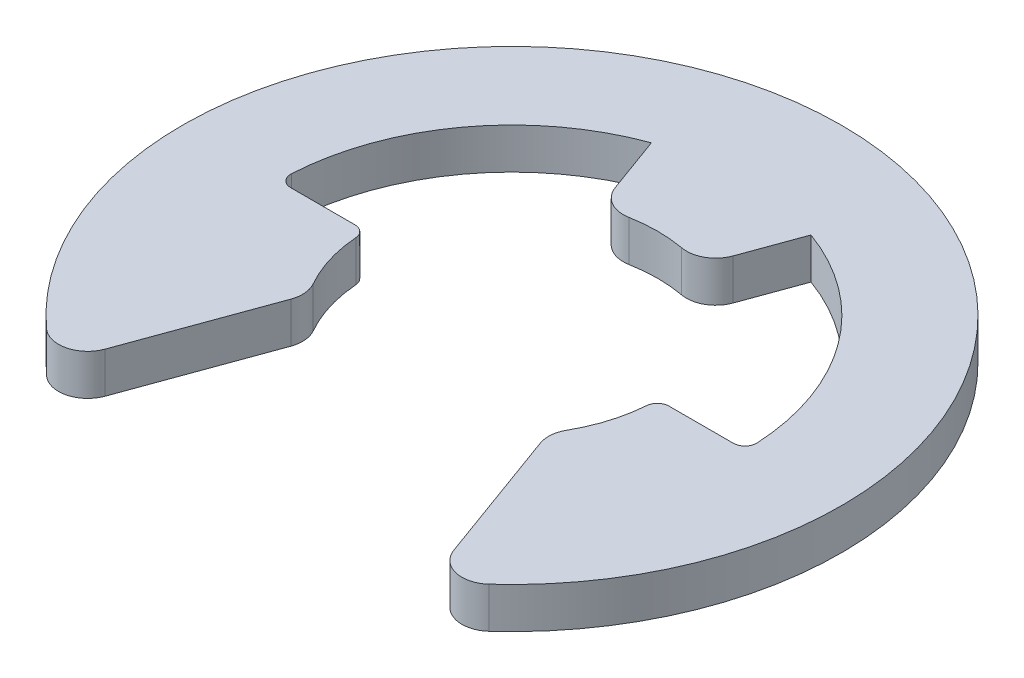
ISO-10303-21;
HEADER;
FILE_DESCRIPTION(('STEP AP214'),'2;1');
FILE_NAME('part.step','',(''),(''),'','','');
FILE_SCHEMA(('AUTOMOTIVE_DESIGN { 1 0 10303 214 1 1 1 1 }'));
ENDSEC;
DATA;
#1=APPLICATION_CONTEXT('core data for automotive mechanical design processes');
#2=APPLICATION_PROTOCOL_DEFINITION('international standard','automotive_design',2000,#1);
#3=PRODUCT_CONTEXT('',#1,'mechanical');
#4=PRODUCT('Part','Part','',(#3));
#5=PRODUCT_RELATED_PRODUCT_CATEGORY('part','',(#4));
#6=PRODUCT_DEFINITION_FORMATION('','',#4);
#7=PRODUCT_DEFINITION_CONTEXT('part definition',#1,'design');
#8=PRODUCT_DEFINITION('design','',#6,#7);
#9=PRODUCT_DEFINITION_SHAPE('','',#8);
#10=(LENGTH_UNIT() NAMED_UNIT(*) SI_UNIT(.MILLI.,.METRE.));
#11=(NAMED_UNIT(*) PLANE_ANGLE_UNIT() SI_UNIT($,.RADIAN.));
#12=(NAMED_UNIT(*) SI_UNIT($,.STERADIAN.) SOLID_ANGLE_UNIT());
#13=UNCERTAINTY_MEASURE_WITH_UNIT(LENGTH_MEASURE(1.E-05),#10,'distance_accuracy_value','');
#14=(GEOMETRIC_REPRESENTATION_CONTEXT(3) GLOBAL_UNCERTAINTY_ASSIGNED_CONTEXT((#13)) GLOBAL_UNIT_ASSIGNED_CONTEXT((#10,
#11,#12)) REPRESENTATION_CONTEXT('',''));
#15=CARTESIAN_POINT('',(0.,0.,0.));
#16=DIRECTION('',(0.,0.,1.));
#17=DIRECTION('',(1.,0.,0.));
#18=AXIS2_PLACEMENT_3D('',#15,#16,#17);
#19=CARTESIAN_POINT('',(0.,0.35,0.));
#20=DIRECTION('',(0.,-1.,0.));
#21=DIRECTION('',(0.,0.,-1.));
#22=AXIS2_PLACEMENT_3D('',#19,#20,#21);
#23=CYLINDRICAL_SURFACE('',#22,4.);
#24=CARTESIAN_POINT('',(0.,0.35,0.));
#25=DIRECTION('',(0.,-1.,0.));
#26=DIRECTION('',(0.,0.,1.));
#27=AXIS2_PLACEMENT_3D('',#24,#25,#26);
#28=CIRCLE('',#27,4.);
#29=CARTESIAN_POINT('',(-3.99445599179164,0.35,-0.210526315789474));
#30=VERTEX_POINT('',#29);
#31=CARTESIAN_POINT('',(-1.36808057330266,0.35,-3.75877048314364));
#32=VERTEX_POINT('',#31);
#33=EDGE_CURVE('E187',#30,#32,#28,.T.);
#34=ORIENTED_EDGE('',*,*,#33,.F.);
#35=DIRECTION('',(0.,-1.,0.));
#36=VECTOR('',#35,1.);
#37=CARTESIAN_POINT('',(-3.99445599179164,0.35,-0.210526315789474));
#38=LINE('',#37,#36);
#39=CARTESIAN_POINT('',(-3.99445599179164,-0.35,-0.210526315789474));
#40=VERTEX_POINT('',#39);
#41=EDGE_CURVE('E328',#30,#40,#38,.T.);
#42=ORIENTED_EDGE('',*,*,#41,.T.);
#43=CARTESIAN_POINT('',(0.,-0.35,0.));
#44=DIRECTION('',(0.,-1.,0.));
#45=DIRECTION('',(0.,0.,1.));
#46=AXIS2_PLACEMENT_3D('',#43,#44,#45);
#47=CIRCLE('',#46,4.);
#48=CARTESIAN_POINT('',(-1.36808057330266,-0.35,-3.75877048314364));
#49=VERTEX_POINT('',#48);
#50=EDGE_CURVE('E211',#40,#49,#47,.T.);
#51=ORIENTED_EDGE('',*,*,#50,.T.);
#52=DIRECTION('',(0.,-1.,0.));
#53=VECTOR('',#52,1.);
#54=CARTESIAN_POINT('',(-1.36808057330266,0.35,-3.75877048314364));
#55=LINE('',#54,#53);
#56=EDGE_CURVE('E204',#32,#49,#55,.T.);
#57=ORIENTED_EDGE('',*,*,#56,.F.);
#58=EDGE_LOOP('',(#34,#42,#51,#57));
#59=FACE_BOUND('',#58,.T.);
#60=ADVANCED_FACE('F39',(#59),#23,.F.);
#61=CARTESIAN_POINT('',(-1.36808057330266,0.35,-3.75877048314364));
#62=DIRECTION('',(0.939692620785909,0.,-0.342020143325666));
#63=DIRECTION('',(-0.342020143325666,0.,-0.939692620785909));
#64=AXIS2_PLACEMENT_3D('',#61,#62,#63);
#65=PLANE('',#64);
#66=DIRECTION('',(0.342020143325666,0.,0.939692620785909));
#67=VECTOR('',#66,1.);
#68=CARTESIAN_POINT('',(-1.36808057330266,-0.35,-3.75877048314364));
#69=LINE('',#68,#67);
#70=CARTESIAN_POINT('',(-1.0117092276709,-0.35,-2.77964825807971));
#71=VERTEX_POINT('',#70);
#72=EDGE_CURVE('E446',#49,#71,#69,.T.);
#73=ORIENTED_EDGE('',*,*,#72,.T.);
#74=DIRECTION('',(0.,-1.,0.));
#75=VECTOR('',#74,1.);
#76=CARTESIAN_POINT('',(-1.0117092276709,0.35,-2.77964825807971));
#77=LINE('',#76,#75);
#78=CARTESIAN_POINT('',(-1.0117092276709,0.35,-2.77964825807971));
#79=VERTEX_POINT('',#78);
#80=EDGE_CURVE('E206',#71,#79,#77,.F.);
#81=ORIENTED_EDGE('',*,*,#80,.T.);
#82=DIRECTION('',(0.342020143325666,0.,0.939692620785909));
#83=VECTOR('',#82,1.);
#84=CARTESIAN_POINT('',(-1.36808057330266,0.35,-3.75877048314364));
#85=LINE('',#84,#83);
#86=EDGE_CURVE('E191',#32,#79,#85,.T.);
#87=ORIENTED_EDGE('',*,*,#86,.F.);
#88=ORIENTED_EDGE('',*,*,#56,.T.);
#89=EDGE_LOOP('',(#73,#81,#87,#88));
#90=FACE_BOUND('',#89,.T.);
#91=ADVANCED_FACE('F203',(#90),#65,.F.);
#92=CARTESIAN_POINT('',(0.,0.35,0.));
#93=DIRECTION('',(0.,-1.,0.));
#94=DIRECTION('',(0.,0.,-1.));
#95=AXIS2_PLACEMENT_3D('',#92,#93,#94);
#96=CYLINDRICAL_SURFACE('',#95,2.5);
#97=CARTESIAN_POINT('',(0.,-0.35,0.));
#98=DIRECTION('',(0.,-1.,0.));
#99=DIRECTION('',(0.,0.,1.));
#100=AXIS2_PLACEMENT_3D('',#97,#98,#99);
#101=CIRCLE('',#100,2.5);
#102=CARTESIAN_POINT('',(-0.451552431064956,-0.35,-2.45888194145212));
#103=VERTEX_POINT('',#102);
#104=CARTESIAN_POINT('',(0.451552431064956,-0.35,-2.45888194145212));
#105=VERTEX_POINT('',#104);
#106=EDGE_CURVE('E449',#103,#105,#101,.T.);
#107=ORIENTED_EDGE('',*,*,#106,.T.);
#108=DIRECTION('',(0.,-1.,0.));
#109=VECTOR('',#108,1.);
#110=CARTESIAN_POINT('',(0.451552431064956,0.35,-2.45888194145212));
#111=LINE('',#110,#109);
#112=CARTESIAN_POINT('',(0.451552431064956,0.35,-2.45888194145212));
#113=VERTEX_POINT('',#112);
#114=EDGE_CURVE('E290',#105,#113,#111,.F.);
#115=ORIENTED_EDGE('',*,*,#114,.T.);
#116=CARTESIAN_POINT('',(0.,0.35,0.));
#117=DIRECTION('',(0.,-1.,0.));
#118=DIRECTION('',(0.,0.,1.));
#119=AXIS2_PLACEMENT_3D('',#116,#117,#118);
#120=CIRCLE('',#119,2.5);
#121=CARTESIAN_POINT('',(-0.451552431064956,0.35,-2.45888194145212));
#122=VERTEX_POINT('',#121);
#123=EDGE_CURVE('E208',#122,#113,#120,.T.);
#124=ORIENTED_EDGE('',*,*,#123,.F.);
#125=DIRECTION('',(0.,-1.,0.));
#126=VECTOR('',#125,1.);
#127=CARTESIAN_POINT('',(-0.451552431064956,0.35,-2.45888194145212));
#128=LINE('',#127,#126);
#129=EDGE_CURVE('E286',#122,#103,#128,.T.);
#130=ORIENTED_EDGE('',*,*,#129,.T.);
#131=EDGE_LOOP('',(#107,#115,#124,#130));
#132=FACE_BOUND('',#131,.T.);
#133=ADVANCED_FACE('F371',(#132),#96,.F.);
#134=CARTESIAN_POINT('',(0.855050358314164,0.35,-2.34923155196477));
#135=DIRECTION('',(-0.939692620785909,0.,-0.342020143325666));
#136=DIRECTION('',(-0.342020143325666,0.,0.93969262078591));
#137=AXIS2_PLACEMENT_3D('',#134,#135,#136);
#138=PLANE('',#137);
#139=DIRECTION('',(0.342020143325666,0.,-0.93969262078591));
#140=VECTOR('',#139,1.);
#141=CARTESIAN_POINT('',(0.855050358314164,0.35,-2.34923155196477));
#142=LINE('',#141,#140);
#143=CARTESIAN_POINT('',(1.0117092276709,0.35,-2.77964825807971));
#144=VERTEX_POINT('',#143);
#145=CARTESIAN_POINT('',(1.36808057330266,0.35,-3.75877048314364));
#146=VERTEX_POINT('',#145);
#147=EDGE_CURVE('E424',#144,#146,#142,.T.);
#148=ORIENTED_EDGE('',*,*,#147,.F.);
#149=DIRECTION('',(0.,-1.,0.));
#150=VECTOR('',#149,1.);
#151=CARTESIAN_POINT('',(1.0117092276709,0.35,-2.77964825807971));
#152=LINE('',#151,#150);
#153=CARTESIAN_POINT('',(1.0117092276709,-0.35,-2.77964825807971));
#154=VERTEX_POINT('',#153);
#155=EDGE_CURVE('E282',#144,#154,#152,.T.);
#156=ORIENTED_EDGE('',*,*,#155,.T.);
#157=DIRECTION('',(0.342020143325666,0.,-0.93969262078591));
#158=VECTOR('',#157,1.);
#159=CARTESIAN_POINT('',(0.855050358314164,-0.35,-2.34923155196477));
#160=LINE('',#159,#158);
#161=CARTESIAN_POINT('',(1.36808057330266,-0.35,-3.75877048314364));
#162=VERTEX_POINT('',#161);
#163=EDGE_CURVE('E453',#154,#162,#160,.T.);
#164=ORIENTED_EDGE('',*,*,#163,.T.);
#165=DIRECTION('',(0.,-1.,0.));
#166=VECTOR('',#165,1.);
#167=CARTESIAN_POINT('',(1.36808057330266,0.35,-3.75877048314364));
#168=LINE('',#167,#166);
#169=EDGE_CURVE('E215',#146,#162,#168,.T.);
#170=ORIENTED_EDGE('',*,*,#169,.F.);
#171=EDGE_LOOP('',(#148,#156,#164,#170));
#172=FACE_BOUND('',#171,.T.);
#173=ADVANCED_FACE('F527',(#172),#138,.F.);
#174=CARTESIAN_POINT('',(0.,0.35,0.));
#175=DIRECTION('',(0.,-1.,0.));
#176=DIRECTION('',(0.,0.,-1.));
#177=AXIS2_PLACEMENT_3D('',#174,#175,#176);
#178=CYLINDRICAL_SURFACE('',#177,4.);
#179=CARTESIAN_POINT('',(0.,-0.35,0.));
#180=DIRECTION('',(0.,-1.,0.));
#181=DIRECTION('',(0.,0.,1.));
#182=AXIS2_PLACEMENT_3D('',#179,#180,#181);
#183=CIRCLE('',#182,4.);
#184=CARTESIAN_POINT('',(3.99445599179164,-0.35,-0.210526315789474));
#185=VERTEX_POINT('',#184);
#186=EDGE_CURVE('E456',#162,#185,#183,.T.);
#187=ORIENTED_EDGE('',*,*,#186,.T.);
#188=DIRECTION('',(0.,-1.,0.));
#189=VECTOR('',#188,1.);
#190=CARTESIAN_POINT('',(3.99445599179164,0.35,-0.210526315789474));
#191=LINE('',#190,#189);
#192=CARTESIAN_POINT('',(3.99445599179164,0.35,-0.210526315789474));
#193=VERTEX_POINT('',#192);
#194=EDGE_CURVE('E309',#185,#193,#191,.F.);
#195=ORIENTED_EDGE('',*,*,#194,.T.);
#196=CARTESIAN_POINT('',(0.,0.35,0.));
#197=DIRECTION('',(0.,-1.,0.));
#198=DIRECTION('',(0.,0.,1.));
#199=AXIS2_PLACEMENT_3D('',#196,#197,#198);
#200=CIRCLE('',#199,4.);
#201=EDGE_CURVE('E411',#146,#193,#200,.T.);
#202=ORIENTED_EDGE('',*,*,#201,.F.);
#203=ORIENTED_EDGE('',*,*,#169,.T.);
#204=EDGE_LOOP('',(#187,#195,#202,#203));
#205=FACE_BOUND('',#204,.T.);
#206=ADVANCED_FACE('F521',(#205),#178,.F.);
#207=CARTESIAN_POINT('',(2.5,0.35,0.));
#208=DIRECTION('',(0.,0.,1.));
#209=DIRECTION('',(1.,0.,0.));
#210=AXIS2_PLACEMENT_3D('',#207,#208,#209);
#211=PLANE('',#210);
#212=DIRECTION('',(-1.,0.,0.));
#213=VECTOR('',#212,1.);
#214=CARTESIAN_POINT('',(2.5,0.35,0.));
#215=LINE('',#214,#213);
#216=CARTESIAN_POINT('',(3.79473319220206,0.35,0.));
#217=VERTEX_POINT('',#216);
#218=CARTESIAN_POINT('',(2.69258240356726,0.35,0.));
#219=VERTEX_POINT('',#218);
#220=EDGE_CURVE('E408',#217,#219,#215,.T.);
#221=ORIENTED_EDGE('',*,*,#220,.F.);
#222=DIRECTION('',(0.,1.,0.));
#223=VECTOR('',#222,1.);
#224=CARTESIAN_POINT('',(3.79473319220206,-0.35,0.));
#225=LINE('',#224,#223);
#226=CARTESIAN_POINT('',(3.79473319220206,-0.35,0.));
#227=VERTEX_POINT('',#226);
#228=EDGE_CURVE('E305',#217,#227,#225,.F.);
#229=ORIENTED_EDGE('',*,*,#228,.T.);
#230=DIRECTION('',(-1.,0.,0.));
#231=VECTOR('',#230,1.);
#232=CARTESIAN_POINT('',(2.5,-0.35,0.));
#233=LINE('',#232,#231);
#234=CARTESIAN_POINT('',(2.69258240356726,-0.35,0.));
#235=VERTEX_POINT('',#234);
#236=EDGE_CURVE('E460',#227,#235,#233,.T.);
#237=ORIENTED_EDGE('',*,*,#236,.T.);
#238=DIRECTION('',(0.,-1.,0.));
#239=VECTOR('',#238,1.);
#240=CARTESIAN_POINT('',(2.69258240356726,0.35,0.));
#241=LINE('',#240,#239);
#242=EDGE_CURVE('E302',#235,#219,#241,.F.);
#243=ORIENTED_EDGE('',*,*,#242,.T.);
#244=EDGE_LOOP('',(#221,#229,#237,#243));
#245=FACE_BOUND('',#244,.T.);
#246=ADVANCED_FACE('F413',(#245),#211,.F.);
#247=CARTESIAN_POINT('',(0.,0.35,0.));
#248=DIRECTION('',(0.,-1.,0.));
#249=DIRECTION('',(0.,0.,-1.));
#250=AXIS2_PLACEMENT_3D('',#247,#248,#249);
#251=CYLINDRICAL_SURFACE('',#250,2.50000000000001);
#252=CARTESIAN_POINT('',(0.,0.35,0.));
#253=DIRECTION('',(0.,-1.,0.));
#254=DIRECTION('',(0.,0.,1.));
#255=AXIS2_PLACEMENT_3D('',#252,#253,#254);
#256=CIRCLE('',#255,2.50000000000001);
#257=CARTESIAN_POINT('',(2.49313185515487,0.35,0.185185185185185));
#258=VERTEX_POINT('',#257);
#259=CARTESIAN_POINT('',(2.17361200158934,0.35,1.23507524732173));
#260=VERTEX_POINT('',#259);
#261=EDGE_CURVE('E418',#258,#260,#256,.T.);
#262=ORIENTED_EDGE('',*,*,#261,.F.);
#263=DIRECTION('',(0.,-1.,0.));
#264=VECTOR('',#263,1.);
#265=CARTESIAN_POINT('',(2.49313185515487,0.35,0.185185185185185));
#266=LINE('',#265,#264);
#267=CARTESIAN_POINT('',(2.49313185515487,-0.35,0.185185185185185));
#268=VERTEX_POINT('',#267);
#269=EDGE_CURVE('E312',#258,#268,#266,.T.);
#270=ORIENTED_EDGE('',*,*,#269,.T.);
#271=CARTESIAN_POINT('',(0.,-0.35,0.));
#272=DIRECTION('',(0.,-1.,0.));
#273=DIRECTION('',(0.,0.,1.));
#274=AXIS2_PLACEMENT_3D('',#271,#272,#273);
#275=CIRCLE('',#274,2.50000000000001);
#276=CARTESIAN_POINT('',(2.17361200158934,-0.35,1.23507524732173));
#277=VERTEX_POINT('',#276);
#278=EDGE_CURVE('E463',#268,#277,#275,.T.);
#279=ORIENTED_EDGE('',*,*,#278,.T.);
#280=DIRECTION('',(0.,-1.,0.));
#281=VECTOR('',#280,1.);
#282=CARTESIAN_POINT('',(2.17361200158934,0.35,1.23507524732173));
#283=LINE('',#282,#281);
#284=EDGE_CURVE('E249',#277,#260,#283,.F.);
#285=ORIENTED_EDGE('',*,*,#284,.T.);
#286=EDGE_LOOP('',(#262,#270,#279,#285));
#287=FACE_BOUND('',#286,.T.);
#288=ADVANCED_FACE('F512',(#287),#251,.F.);
#289=CARTESIAN_POINT('',(2.05499999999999,0.35,1.42371872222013));
#290=DIRECTION('',(0.939692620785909,0.,-0.342020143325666));
#291=DIRECTION('',(-0.342020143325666,0.,-0.939692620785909));
#292=AXIS2_PLACEMENT_3D('',#289,#290,#291);
#293=PLANE('',#292);
#294=DIRECTION('',(0.342020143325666,0.,0.939692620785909));
#295=VECTOR('',#294,1.);
#296=CARTESIAN_POINT('',(2.05499999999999,0.35,1.42371872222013));
#297=LINE('',#296,#295);
#298=CARTESIAN_POINT('',(2.13848809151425,0.35,1.65310036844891));
#299=VERTEX_POINT('',#298);
#300=CARTESIAN_POINT('',(2.98811263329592,0.35,3.98742461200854));
#301=VERTEX_POINT('',#300);
#302=EDGE_CURVE('E422',#299,#301,#297,.T.);
#303=ORIENTED_EDGE('',*,*,#302,.F.);
#304=DIRECTION('',(0.,-1.,0.));
#305=VECTOR('',#304,1.);
#306=CARTESIAN_POINT('',(2.13848809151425,0.35,1.65310036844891));
#307=LINE('',#306,#305);
#308=CARTESIAN_POINT('',(2.13848809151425,-0.35,1.65310036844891));
#309=VERTEX_POINT('',#308);
#310=EDGE_CURVE('E220',#299,#309,#307,.T.);
#311=ORIENTED_EDGE('',*,*,#310,.T.);
#312=DIRECTION('',(0.342020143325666,0.,0.939692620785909));
#313=VECTOR('',#312,1.);
#314=CARTESIAN_POINT('',(2.05499999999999,-0.35,1.42371872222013));
#315=LINE('',#314,#313);
#316=CARTESIAN_POINT('',(2.98811263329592,-0.35,3.98742461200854));
#317=VERTEX_POINT('',#316);
#318=EDGE_CURVE('E466',#309,#317,#315,.T.);
#319=ORIENTED_EDGE('',*,*,#318,.T.);
#320=DIRECTION('',(0.,-1.,0.));
#321=VECTOR('',#320,1.);
#322=CARTESIAN_POINT('',(2.98811263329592,0.35,3.98742461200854));
#323=LINE('',#322,#321);
#324=EDGE_CURVE('E214',#317,#301,#323,.F.);
#325=ORIENTED_EDGE('',*,*,#324,.T.);
#326=EDGE_LOOP('',(#303,#311,#319,#325));
#327=FACE_BOUND('',#326,.T.);
#328=ADVANCED_FACE('F506',(#327),#293,.F.);
#329=CARTESIAN_POINT('',(0.,0.35,0.));
#330=DIRECTION('',(0.,-1.,0.));
#331=DIRECTION('',(0.,0.,-1.));
#332=AXIS2_PLACEMENT_3D('',#329,#330,#331);
#333=CYLINDRICAL_SURFACE('',#332,5.65);
#334=CARTESIAN_POINT('',(0.,0.35,0.));
#335=DIRECTION('',(0.,1.,0.));
#336=DIRECTION('',(0.,0.,1.));
#337=AXIS2_PLACEMENT_3D('',#334,#335,#336);
#338=CIRCLE('',#337,5.65);
#339=CARTESIAN_POINT('',(3.79368311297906,0.35,4.18694022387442));
#340=VERTEX_POINT('',#339);
#341=CARTESIAN_POINT('',(-3.79368311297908,0.35,4.18694022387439));
#342=VERTEX_POINT('',#341);
#343=EDGE_CURVE('E431',#340,#342,#338,.T.);
#344=ORIENTED_EDGE('',*,*,#343,.F.);
#345=DIRECTION('',(0.,-1.,0.));
#346=VECTOR('',#345,1.);
#347=CARTESIAN_POINT('',(3.79368311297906,0.35,4.18694022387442));
#348=LINE('',#347,#346);
#349=CARTESIAN_POINT('',(3.79368311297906,-0.35,4.18694022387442));
#350=VERTEX_POINT('',#349);
#351=EDGE_CURVE('E298',#340,#350,#348,.T.);
#352=ORIENTED_EDGE('',*,*,#351,.T.);
#353=CARTESIAN_POINT('',(0.,-0.35,0.));
#354=DIRECTION('',(0.,1.,0.));
#355=DIRECTION('',(0.,0.,1.));
#356=AXIS2_PLACEMENT_3D('',#353,#354,#355);
#357=CIRCLE('',#356,5.65);
#358=CARTESIAN_POINT('',(-3.79368311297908,-0.35,4.18694022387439));
#359=VERTEX_POINT('',#358);
#360=EDGE_CURVE('E470',#350,#359,#357,.T.);
#361=ORIENTED_EDGE('',*,*,#360,.T.);
#362=DIRECTION('',(0.,-1.,0.));
#363=VECTOR('',#362,1.);
#364=CARTESIAN_POINT('',(-3.79368311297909,0.35,4.18694022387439));
#365=LINE('',#364,#363);
#366=EDGE_CURVE('E295',#359,#342,#365,.F.);
#367=ORIENTED_EDGE('',*,*,#366,.T.);
#368=EDGE_LOOP('',(#344,#352,#361,#367));
#369=FACE_BOUND('',#368,.T.);
#370=ADVANCED_FACE('F499',(#369),#333,.T.);
#371=CARTESIAN_POINT('',(-3.22526147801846,0.35,4.63898570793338));
#372=DIRECTION('',(-0.939692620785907,0.,-0.342020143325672));
#373=DIRECTION('',(-0.342020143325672,0.,0.939692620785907));
#374=AXIS2_PLACEMENT_3D('',#371,#372,#373);
#375=PLANE('',#374);
#376=DIRECTION('',(0.342020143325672,0.,-0.939692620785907));
#377=VECTOR('',#376,1.);
#378=CARTESIAN_POINT('',(-3.22526147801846,-0.35,4.63898570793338));
#379=LINE('',#378,#377);
#380=CARTESIAN_POINT('',(-2.98811263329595,-0.35,3.98742461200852));
#381=VERTEX_POINT('',#380);
#382=CARTESIAN_POINT('',(-2.13848809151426,-0.35,1.65310036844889));
#383=VERTEX_POINT('',#382);
#384=EDGE_CURVE('E474',#381,#383,#379,.T.);
#385=ORIENTED_EDGE('',*,*,#384,.T.);
#386=DIRECTION('',(0.,-1.,0.));
#387=VECTOR('',#386,1.);
#388=CARTESIAN_POINT('',(-2.13848809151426,0.35,1.65310036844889));
#389=LINE('',#388,#387);
#390=CARTESIAN_POINT('',(-2.13848809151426,0.35,1.65310036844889));
#391=VERTEX_POINT('',#390);
#392=EDGE_CURVE('E279',#383,#391,#389,.F.);
#393=ORIENTED_EDGE('',*,*,#392,.T.);
#394=DIRECTION('',(0.342020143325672,0.,-0.939692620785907));
#395=VECTOR('',#394,1.);
#396=CARTESIAN_POINT('',(-3.22526147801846,0.35,4.63898570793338));
#397=LINE('',#396,#395);
#398=CARTESIAN_POINT('',(-2.98811263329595,0.35,3.98742461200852));
#399=VERTEX_POINT('',#398);
#400=EDGE_CURVE('E435',#399,#391,#397,.T.);
#401=ORIENTED_EDGE('',*,*,#400,.F.);
#402=DIRECTION('',(0.,-1.,0.));
#403=VECTOR('',#402,1.);
#404=CARTESIAN_POINT('',(-2.98811263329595,0.35,3.98742461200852));
#405=LINE('',#404,#403);
#406=EDGE_CURVE('E275',#399,#381,#405,.T.);
#407=ORIENTED_EDGE('',*,*,#406,.T.);
#408=EDGE_LOOP('',(#385,#393,#401,#407));
#409=FACE_BOUND('',#408,.T.);
#410=ADVANCED_FACE('F491',(#409),#375,.F.);
#411=CARTESIAN_POINT('',(0.,0.35,0.));
#412=DIRECTION('',(0.,-1.,0.));
#413=DIRECTION('',(0.,0.,-1.));
#414=AXIS2_PLACEMENT_3D('',#411,#412,#413);
#415=CYLINDRICAL_SURFACE('',#414,2.50000000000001);
#416=CARTESIAN_POINT('',(0.,-0.35,0.));
#417=DIRECTION('',(0.,-1.,0.));
#418=DIRECTION('',(0.,0.,1.));
#419=AXIS2_PLACEMENT_3D('',#416,#417,#418);
#420=CIRCLE('',#419,2.50000000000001);
#421=CARTESIAN_POINT('',(-2.17361200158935,-0.35,1.23507524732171));
#422=VERTEX_POINT('',#421);
#423=CARTESIAN_POINT('',(-2.49313185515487,-0.35,0.185185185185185));
#424=VERTEX_POINT('',#423);
#425=EDGE_CURVE('E354',#422,#424,#420,.T.);
#426=ORIENTED_EDGE('',*,*,#425,.T.);
#427=DIRECTION('',(0.,-1.,0.));
#428=VECTOR('',#427,1.);
#429=CARTESIAN_POINT('',(-2.49313185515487,0.35,0.185185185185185));
#430=LINE('',#429,#428);
#431=CARTESIAN_POINT('',(-2.49313185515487,0.35,0.185185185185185));
#432=VERTEX_POINT('',#431);
#433=EDGE_CURVE('E337',#424,#432,#430,.F.);
#434=ORIENTED_EDGE('',*,*,#433,.T.);
#435=CARTESIAN_POINT('',(0.,0.35,0.));
#436=DIRECTION('',(0.,-1.,0.));
#437=DIRECTION('',(0.,0.,1.));
#438=AXIS2_PLACEMENT_3D('',#435,#436,#437);
#439=CIRCLE('',#438,2.50000000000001);
#440=CARTESIAN_POINT('',(-2.17361200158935,0.35,1.23507524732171));
#441=VERTEX_POINT('',#440);
#442=EDGE_CURVE('E439',#441,#432,#439,.T.);
#443=ORIENTED_EDGE('',*,*,#442,.F.);
#444=DIRECTION('',(0.,-1.,0.));
#445=VECTOR('',#444,1.);
#446=CARTESIAN_POINT('',(-2.17361200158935,0.35,1.23507524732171));
#447=LINE('',#446,#445);
#448=EDGE_CURVE('E271',#441,#422,#447,.T.);
#449=ORIENTED_EDGE('',*,*,#448,.T.);
#450=EDGE_LOOP('',(#426,#434,#443,#449));
#451=FACE_BOUND('',#450,.T.);
#452=ADVANCED_FACE('F483',(#451),#415,.F.);
#453=CARTESIAN_POINT('',(-2.5,0.35,0.));
#454=DIRECTION('',(0.,0.,1.));
#455=DIRECTION('',(1.,0.,0.));
#456=AXIS2_PLACEMENT_3D('',#453,#454,#455);
#457=PLANE('',#456);
#458=DIRECTION('',(-1.,0.,0.));
#459=VECTOR('',#458,1.);
#460=CARTESIAN_POINT('',(-2.5,-0.35,0.));
#461=LINE('',#460,#459);
#462=CARTESIAN_POINT('',(-2.69258240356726,-0.35,0.));
#463=VERTEX_POINT('',#462);
#464=CARTESIAN_POINT('',(-3.79473319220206,-0.35,0.));
#465=VERTEX_POINT('',#464);
#466=EDGE_CURVE('E198',#463,#465,#461,.T.);
#467=ORIENTED_EDGE('',*,*,#466,.T.);
#468=DIRECTION('',(0.,1.,0.));
#469=VECTOR('',#468,1.);
#470=CARTESIAN_POINT('',(-3.79473319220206,0.35,0.));
#471=LINE('',#470,#469);
#472=CARTESIAN_POINT('',(-3.79473319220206,0.35,0.));
#473=VERTEX_POINT('',#472);
#474=EDGE_CURVE('E61',#465,#473,#471,.T.);
#475=ORIENTED_EDGE('',*,*,#474,.T.);
#476=DIRECTION('',(-1.,0.,0.));
#477=VECTOR('',#476,1.);
#478=CARTESIAN_POINT('',(-2.5,0.35,0.));
#479=LINE('',#478,#477);
#480=CARTESIAN_POINT('',(-2.69258240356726,0.35,0.));
#481=VERTEX_POINT('',#480);
#482=EDGE_CURVE('E224',#481,#473,#479,.T.);
#483=ORIENTED_EDGE('',*,*,#482,.F.);
#484=DIRECTION('',(0.,-1.,0.));
#485=VECTOR('',#484,1.);
#486=CARTESIAN_POINT('',(-2.69258240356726,0.35,0.));
#487=LINE('',#486,#485);
#488=EDGE_CURVE('E331',#481,#463,#487,.T.);
#489=ORIENTED_EDGE('',*,*,#488,.T.);
#490=EDGE_LOOP('',(#467,#475,#483,#489));
#491=FACE_BOUND('',#490,.T.);
#492=ADVANCED_FACE('F351',(#491),#457,.F.);
#493=CARTESIAN_POINT('',(0.,0.35,0.));
#494=DIRECTION('',(0.,1.,0.));
#495=DIRECTION('',(0.,0.,1.));
#496=AXIS2_PLACEMENT_3D('',#493,#494,#495);
#497=PLANE('',#496);
#498=ORIENTED_EDGE('',*,*,#220,.T.);
#499=CARTESIAN_POINT('',(2.69258240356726,0.35,0.2));
#500=DIRECTION('',(0.,1.,0.));
#501=DIRECTION('',(0.,0.,1.));
#502=AXIS2_PLACEMENT_3D('',#499,#500,#501);
#503=CIRCLE('',#502,0.2);
#504=EDGE_CURVE('E325',#219,#258,#503,.T.);
#505=ORIENTED_EDGE('',*,*,#504,.T.);
#506=ORIENTED_EDGE('',*,*,#261,.T.);
#507=CARTESIAN_POINT('',(2.60833440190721,0.35,1.48209029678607));
#508=DIRECTION('',(0.,1.,0.));
#509=DIRECTION('',(0.,0.,1.));
#510=AXIS2_PLACEMENT_3D('',#507,#508,#509);
#511=CIRCLE('',#510,0.5);
#512=EDGE_CURVE('E268',#260,#299,#511,.T.);
#513=ORIENTED_EDGE('',*,*,#512,.T.);
#514=ORIENTED_EDGE('',*,*,#302,.T.);
#515=CARTESIAN_POINT('',(3.45795894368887,0.35,3.81641454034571));
#516=DIRECTION('',(0.,1.,0.));
#517=DIRECTION('',(0.,0.,1.));
#518=AXIS2_PLACEMENT_3D('',#515,#516,#517);
#519=CIRCLE('',#518,0.5);
#520=EDGE_CURVE('E256',#301,#340,#519,.T.);
#521=ORIENTED_EDGE('',*,*,#520,.T.);
#522=ORIENTED_EDGE('',*,*,#343,.T.);
#523=CARTESIAN_POINT('',(-3.4579589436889,0.35,3.81641454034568));
#524=DIRECTION('',(0.,1.,0.));
#525=DIRECTION('',(0.,0.,1.));
#526=AXIS2_PLACEMENT_3D('',#523,#524,#525);
#527=CIRCLE('',#526,0.5);
#528=EDGE_CURVE('E253',#342,#399,#527,.T.);
#529=ORIENTED_EDGE('',*,*,#528,.T.);
#530=ORIENTED_EDGE('',*,*,#400,.T.);
#531=CARTESIAN_POINT('',(-2.60833440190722,0.35,1.48209029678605));
#532=DIRECTION('',(0.,1.,0.));
#533=DIRECTION('',(0.,0.,1.));
#534=AXIS2_PLACEMENT_3D('',#531,#532,#533);
#535=CIRCLE('',#534,0.5);
#536=EDGE_CURVE('E265',#391,#441,#535,.T.);
#537=ORIENTED_EDGE('',*,*,#536,.T.);
#538=ORIENTED_EDGE('',*,*,#442,.T.);
#539=CARTESIAN_POINT('',(-2.69258240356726,0.35,0.2));
#540=DIRECTION('',(0.,1.,0.));
#541=DIRECTION('',(0.,0.,1.));
#542=AXIS2_PLACEMENT_3D('',#539,#540,#541);
#543=CIRCLE('',#542,0.2);
#544=EDGE_CURVE('E322',#432,#481,#543,.T.);
#545=ORIENTED_EDGE('',*,*,#544,.T.);
#546=ORIENTED_EDGE('',*,*,#482,.T.);
#547=CARTESIAN_POINT('',(-3.79473319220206,0.35,-0.2));
#548=DIRECTION('',(0.,1.,0.));
#549=DIRECTION('',(0.,0.,1.));
#550=AXIS2_PLACEMENT_3D('',#547,#548,#549);
#551=CIRCLE('',#550,0.2);
#552=EDGE_CURVE('E11',#473,#30,#551,.F.);
#553=ORIENTED_EDGE('',*,*,#552,.T.);
#554=ORIENTED_EDGE('',*,*,#33,.T.);
#555=ORIENTED_EDGE('',*,*,#86,.T.);
#556=CARTESIAN_POINT('',(-0.541862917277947,0.35,-2.95065832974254));
#557=DIRECTION('',(0.,1.,0.));
#558=DIRECTION('',(0.,0.,1.));
#559=AXIS2_PLACEMENT_3D('',#556,#557,#558);
#560=CIRCLE('',#559,0.5);
#561=EDGE_CURVE('E259',#79,#122,#560,.T.);
#562=ORIENTED_EDGE('',*,*,#561,.T.);
#563=ORIENTED_EDGE('',*,*,#123,.T.);
#564=CARTESIAN_POINT('',(0.541862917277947,0.35,-2.95065832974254));
#565=DIRECTION('',(0.,1.,0.));
#566=DIRECTION('',(0.,0.,1.));
#567=AXIS2_PLACEMENT_3D('',#564,#565,#566);
#568=CIRCLE('',#567,0.5);
#569=EDGE_CURVE('E262',#113,#144,#568,.T.);
#570=ORIENTED_EDGE('',*,*,#569,.T.);
#571=ORIENTED_EDGE('',*,*,#147,.T.);
#572=ORIENTED_EDGE('',*,*,#201,.T.);
#573=CARTESIAN_POINT('',(3.79473319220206,0.35,-0.2));
#574=DIRECTION('',(0.,1.,0.));
#575=DIRECTION('',(0.,0.,1.));
#576=AXIS2_PLACEMENT_3D('',#573,#574,#575);
#577=CIRCLE('',#576,0.2);
#578=EDGE_CURVE('E343',#193,#217,#577,.F.);
#579=ORIENTED_EDGE('',*,*,#578,.T.);
#580=EDGE_LOOP('',(#498,#505,#506,#513,#514,#521,#522,#529,#530,#537,#538,#545,#546,#553,#554,
#555,#562,#563,#570,#571,#572,#579));
#581=FACE_BOUND('',#580,.T.);
#582=ADVANCED_FACE('F190',(#581),#497,.T.);
#583=CARTESIAN_POINT('',(0.,-0.35,0.));
#584=DIRECTION('',(0.,1.,0.));
#585=DIRECTION('',(0.,0.,1.));
#586=AXIS2_PLACEMENT_3D('',#583,#584,#585);
#587=PLANE('',#586);
#588=ORIENTED_EDGE('',*,*,#278,.F.);
#589=CARTESIAN_POINT('',(2.69258240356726,-0.35,0.2));
#590=DIRECTION('',(0.,1.,0.));
#591=DIRECTION('',(0.,0.,1.));
#592=AXIS2_PLACEMENT_3D('',#589,#590,#591);
#593=CIRCLE('',#592,0.2);
#594=EDGE_CURVE('E319',#268,#235,#593,.F.);
#595=ORIENTED_EDGE('',*,*,#594,.T.);
#596=ORIENTED_EDGE('',*,*,#236,.F.);
#597=CARTESIAN_POINT('',(3.79473319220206,-0.35,-0.2));
#598=DIRECTION('',(0.,1.,0.));
#599=DIRECTION('',(0.,0.,1.));
#600=AXIS2_PLACEMENT_3D('',#597,#598,#599);
#601=CIRCLE('',#600,0.2);
#602=EDGE_CURVE('E340',#227,#185,#601,.T.);
#603=ORIENTED_EDGE('',*,*,#602,.T.);
#604=ORIENTED_EDGE('',*,*,#186,.F.);
#605=ORIENTED_EDGE('',*,*,#163,.F.);
#606=CARTESIAN_POINT('',(0.541862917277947,-0.35,-2.95065832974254));
#607=DIRECTION('',(0.,1.,0.));
#608=DIRECTION('',(0.,0.,1.));
#609=AXIS2_PLACEMENT_3D('',#606,#607,#608);
#610=CIRCLE('',#609,0.5);
#611=EDGE_CURVE('E239',#154,#105,#610,.F.);
#612=ORIENTED_EDGE('',*,*,#611,.T.);
#613=ORIENTED_EDGE('',*,*,#106,.F.);
#614=CARTESIAN_POINT('',(-0.541862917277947,-0.35,-2.95065832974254));
#615=DIRECTION('',(0.,1.,0.));
#616=DIRECTION('',(0.,0.,1.));
#617=AXIS2_PLACEMENT_3D('',#614,#615,#616);
#618=CIRCLE('',#617,0.5);
#619=EDGE_CURVE('E236',#103,#71,#618,.F.);
#620=ORIENTED_EDGE('',*,*,#619,.T.);
#621=ORIENTED_EDGE('',*,*,#72,.F.);
#622=ORIENTED_EDGE('',*,*,#50,.F.);
#623=CARTESIAN_POINT('',(-3.79473319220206,-0.35,-0.2));
#624=DIRECTION('',(0.,1.,0.));
#625=DIRECTION('',(0.,0.,1.));
#626=AXIS2_PLACEMENT_3D('',#623,#624,#625);
#627=CIRCLE('',#626,0.2);
#628=EDGE_CURVE('E48',#40,#465,#627,.T.);
#629=ORIENTED_EDGE('',*,*,#628,.T.);
#630=ORIENTED_EDGE('',*,*,#466,.F.);
#631=CARTESIAN_POINT('',(-2.69258240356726,-0.35,0.2));
#632=DIRECTION('',(0.,1.,0.));
#633=DIRECTION('',(0.,0.,1.));
#634=AXIS2_PLACEMENT_3D('',#631,#632,#633);
#635=CIRCLE('',#634,0.2);
#636=EDGE_CURVE('E316',#463,#424,#635,.F.);
#637=ORIENTED_EDGE('',*,*,#636,.T.);
#638=ORIENTED_EDGE('',*,*,#425,.F.);
#639=CARTESIAN_POINT('',(-2.60833440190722,-0.35,1.48209029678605));
#640=DIRECTION('',(0.,1.,0.));
#641=DIRECTION('',(0.,0.,1.));
#642=AXIS2_PLACEMENT_3D('',#639,#640,#641);
#643=CIRCLE('',#642,0.5);
#644=EDGE_CURVE('E242',#422,#383,#643,.F.);
#645=ORIENTED_EDGE('',*,*,#644,.T.);
#646=ORIENTED_EDGE('',*,*,#384,.F.);
#647=CARTESIAN_POINT('',(-3.4579589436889,-0.35,3.81641454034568));
#648=DIRECTION('',(0.,1.,0.));
#649=DIRECTION('',(0.,0.,1.));
#650=AXIS2_PLACEMENT_3D('',#647,#648,#649);
#651=CIRCLE('',#650,0.5);
#652=EDGE_CURVE('E231',#381,#359,#651,.F.);
#653=ORIENTED_EDGE('',*,*,#652,.T.);
#654=ORIENTED_EDGE('',*,*,#360,.F.);
#655=CARTESIAN_POINT('',(3.45795894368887,-0.35,3.81641454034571));
#656=DIRECTION('',(0.,1.,0.));
#657=DIRECTION('',(0.,0.,1.));
#658=AXIS2_PLACEMENT_3D('',#655,#656,#657);
#659=CIRCLE('',#658,0.5);
#660=EDGE_CURVE('E233',#350,#317,#659,.F.);
#661=ORIENTED_EDGE('',*,*,#660,.T.);
#662=ORIENTED_EDGE('',*,*,#318,.F.);
#663=CARTESIAN_POINT('',(2.60833440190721,-0.35,1.48209029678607));
#664=DIRECTION('',(0.,1.,0.));
#665=DIRECTION('',(0.,0.,1.));
#666=AXIS2_PLACEMENT_3D('',#663,#664,#665);
#667=CIRCLE('',#666,0.5);
#668=EDGE_CURVE('E245',#309,#277,#667,.F.);
#669=ORIENTED_EDGE('',*,*,#668,.T.);
#670=EDGE_LOOP('',(#588,#595,#596,#603,#604,#605,#612,#613,#620,#621,#622,#629,#630,#637,#638,
#645,#646,#653,#654,#661,#662,#669));
#671=FACE_BOUND('',#670,.T.);
#672=ADVANCED_FACE('F349',(#671),#587,.F.);
#673=CARTESIAN_POINT('',(2.60833440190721,0.35,1.48209029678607));
#674=DIRECTION('',(0.,-1.,0.));
#675=DIRECTION('',(0.,0.,-1.));
#676=AXIS2_PLACEMENT_3D('',#673,#674,#675);
#677=CYLINDRICAL_SURFACE('',#676,0.5);
#678=ORIENTED_EDGE('',*,*,#512,.F.);
#679=ORIENTED_EDGE('',*,*,#284,.F.);
#680=ORIENTED_EDGE('',*,*,#668,.F.);
#681=ORIENTED_EDGE('',*,*,#310,.F.);
#682=EDGE_LOOP('',(#678,#679,#680,#681));
#683=FACE_BOUND('',#682,.T.);
#684=ADVANCED_FACE('F375',(#683),#677,.T.);
#685=CARTESIAN_POINT('',(-2.60833440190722,0.35,1.48209029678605));
#686=DIRECTION('',(0.,-1.,0.));
#687=DIRECTION('',(0.,0.,-1.));
#688=AXIS2_PLACEMENT_3D('',#685,#686,#687);
#689=CYLINDRICAL_SURFACE('',#688,0.5);
#690=ORIENTED_EDGE('',*,*,#536,.F.);
#691=ORIENTED_EDGE('',*,*,#392,.F.);
#692=ORIENTED_EDGE('',*,*,#644,.F.);
#693=ORIENTED_EDGE('',*,*,#448,.F.);
#694=EDGE_LOOP('',(#690,#691,#692,#693));
#695=FACE_BOUND('',#694,.T.);
#696=ADVANCED_FACE('F378',(#695),#689,.T.);
#697=CARTESIAN_POINT('',(0.541862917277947,0.35,-2.95065832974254));
#698=DIRECTION('',(0.,-1.,0.));
#699=DIRECTION('',(0.,0.,-1.));
#700=AXIS2_PLACEMENT_3D('',#697,#698,#699);
#701=CYLINDRICAL_SURFACE('',#700,0.5);
#702=ORIENTED_EDGE('',*,*,#569,.F.);
#703=ORIENTED_EDGE('',*,*,#114,.F.);
#704=ORIENTED_EDGE('',*,*,#611,.F.);
#705=ORIENTED_EDGE('',*,*,#155,.F.);
#706=EDGE_LOOP('',(#702,#703,#704,#705));
#707=FACE_BOUND('',#706,.T.);
#708=ADVANCED_FACE('F382',(#707),#701,.T.);
#709=CARTESIAN_POINT('',(-0.541862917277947,0.35,-2.95065832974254));
#710=DIRECTION('',(0.,-1.,0.));
#711=DIRECTION('',(0.,0.,-1.));
#712=AXIS2_PLACEMENT_3D('',#709,#710,#711);
#713=CYLINDRICAL_SURFACE('',#712,0.5);
#714=ORIENTED_EDGE('',*,*,#561,.F.);
#715=ORIENTED_EDGE('',*,*,#80,.F.);
#716=ORIENTED_EDGE('',*,*,#619,.F.);
#717=ORIENTED_EDGE('',*,*,#129,.F.);
#718=EDGE_LOOP('',(#714,#715,#716,#717));
#719=FACE_BOUND('',#718,.T.);
#720=ADVANCED_FACE('F386',(#719),#713,.T.);
#721=CARTESIAN_POINT('',(3.45795894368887,0.35,3.81641454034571));
#722=DIRECTION('',(0.,-1.,0.));
#723=DIRECTION('',(0.,0.,-1.));
#724=AXIS2_PLACEMENT_3D('',#721,#722,#723);
#725=CYLINDRICAL_SURFACE('',#724,0.5);
#726=ORIENTED_EDGE('',*,*,#520,.F.);
#727=ORIENTED_EDGE('',*,*,#324,.F.);
#728=ORIENTED_EDGE('',*,*,#660,.F.);
#729=ORIENTED_EDGE('',*,*,#351,.F.);
#730=EDGE_LOOP('',(#726,#727,#728,#729));
#731=FACE_BOUND('',#730,.T.);
#732=ADVANCED_FACE('F390',(#731),#725,.T.);
#733=CARTESIAN_POINT('',(-3.4579589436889,0.35,3.81641454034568));
#734=DIRECTION('',(0.,-1.,0.));
#735=DIRECTION('',(0.,0.,-1.));
#736=AXIS2_PLACEMENT_3D('',#733,#734,#735);
#737=CYLINDRICAL_SURFACE('',#736,0.5);
#738=ORIENTED_EDGE('',*,*,#528,.F.);
#739=ORIENTED_EDGE('',*,*,#366,.F.);
#740=ORIENTED_EDGE('',*,*,#652,.F.);
#741=ORIENTED_EDGE('',*,*,#406,.F.);
#742=EDGE_LOOP('',(#738,#739,#740,#741));
#743=FACE_BOUND('',#742,.T.);
#744=ADVANCED_FACE('F394',(#743),#737,.T.);
#745=CARTESIAN_POINT('',(3.79473319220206,0.35,-0.2));
#746=DIRECTION('',(0.,-1.,0.));
#747=DIRECTION('',(0.,0.,-1.));
#748=AXIS2_PLACEMENT_3D('',#745,#746,#747);
#749=CYLINDRICAL_SURFACE('',#748,0.2);
#750=ORIENTED_EDGE('',*,*,#578,.F.);
#751=ORIENTED_EDGE('',*,*,#194,.F.);
#752=ORIENTED_EDGE('',*,*,#602,.F.);
#753=ORIENTED_EDGE('',*,*,#228,.F.);
#754=EDGE_LOOP('',(#750,#751,#752,#753));
#755=FACE_BOUND('',#754,.T.);
#756=ADVANCED_FACE('F363',(#755),#749,.F.);
#757=CARTESIAN_POINT('',(2.69258240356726,0.35,0.2));
#758=DIRECTION('',(0.,-1.,0.));
#759=DIRECTION('',(0.,0.,-1.));
#760=AXIS2_PLACEMENT_3D('',#757,#758,#759);
#761=CYLINDRICAL_SURFACE('',#760,0.2);
#762=ORIENTED_EDGE('',*,*,#504,.F.);
#763=ORIENTED_EDGE('',*,*,#242,.F.);
#764=ORIENTED_EDGE('',*,*,#594,.F.);
#765=ORIENTED_EDGE('',*,*,#269,.F.);
#766=EDGE_LOOP('',(#762,#763,#764,#765));
#767=FACE_BOUND('',#766,.T.);
#768=ADVANCED_FACE('F357',(#767),#761,.T.);
#769=CARTESIAN_POINT('',(-3.79473319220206,0.35,-0.2));
#770=DIRECTION('',(0.,-1.,0.));
#771=DIRECTION('',(0.,0.,-1.));
#772=AXIS2_PLACEMENT_3D('',#769,#770,#771);
#773=CYLINDRICAL_SURFACE('',#772,0.2);
#774=ORIENTED_EDGE('',*,*,#552,.F.);
#775=ORIENTED_EDGE('',*,*,#474,.F.);
#776=ORIENTED_EDGE('',*,*,#628,.F.);
#777=ORIENTED_EDGE('',*,*,#41,.F.);
#778=EDGE_LOOP('',(#774,#775,#776,#777));
#779=FACE_BOUND('',#778,.T.);
#780=ADVANCED_FACE('F355',(#779),#773,.F.);
#781=CARTESIAN_POINT('',(-2.69258240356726,0.35,0.2));
#782=DIRECTION('',(0.,-1.,0.));
#783=DIRECTION('',(0.,0.,-1.));
#784=AXIS2_PLACEMENT_3D('',#781,#782,#783);
#785=CYLINDRICAL_SURFACE('',#784,0.2);
#786=ORIENTED_EDGE('',*,*,#544,.F.);
#787=ORIENTED_EDGE('',*,*,#433,.F.);
#788=ORIENTED_EDGE('',*,*,#636,.F.);
#789=ORIENTED_EDGE('',*,*,#488,.F.);
#790=EDGE_LOOP('',(#786,#787,#788,#789));
#791=FACE_BOUND('',#790,.T.);
#792=ADVANCED_FACE('F41',(#791),#785,.T.);
#793=CLOSED_SHELL('',(#60,#91,#133,#173,#206,#246,#288,#328,#370,#410,#452,#492,#582,#672,#684,
#696,#708,#720,#732,#744,#756,#768,#780,#792));
#794=MANIFOLD_SOLID_BREP('B2',#793);
#795=ADVANCED_BREP_SHAPE_REPRESENTATION('',(#18,#794),#14);
#796=SHAPE_DEFINITION_REPRESENTATION(#9,#795);
ENDSEC;
END-ISO-10303-21;
